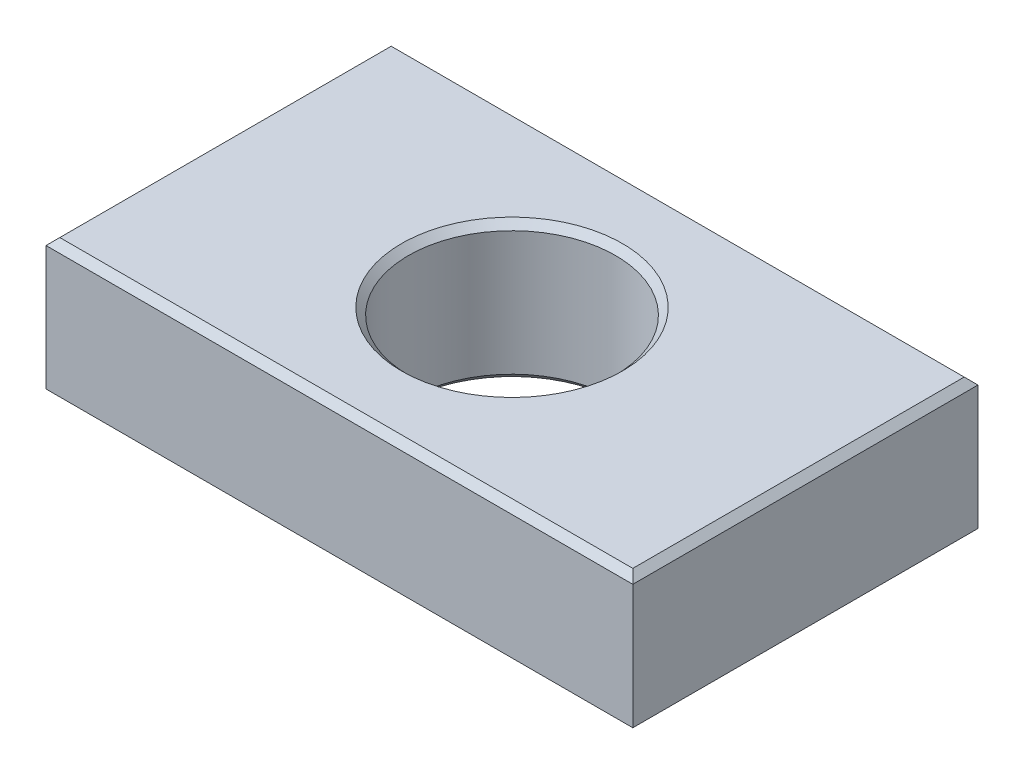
ISO-10303-21;
HEADER;
FILE_DESCRIPTION(('STEP AP214'),'2;1');
FILE_NAME('part.step','',(''),(''),'','','');
FILE_SCHEMA(('AUTOMOTIVE_DESIGN { 1 0 10303 214 1 1 1 1 }'));
ENDSEC;
DATA;
#1=APPLICATION_CONTEXT('core data for automotive mechanical design processes');
#2=APPLICATION_PROTOCOL_DEFINITION('international standard','automotive_design',2000,#1);
#3=PRODUCT_CONTEXT('',#1,'mechanical');
#4=PRODUCT('Part','Part','',(#3));
#5=PRODUCT_RELATED_PRODUCT_CATEGORY('part','',(#4));
#6=PRODUCT_DEFINITION_FORMATION('','',#4);
#7=PRODUCT_DEFINITION_CONTEXT('part definition',#1,'design');
#8=PRODUCT_DEFINITION('design','',#6,#7);
#9=PRODUCT_DEFINITION_SHAPE('','',#8);
#10=(LENGTH_UNIT() NAMED_UNIT(*) SI_UNIT(.MILLI.,.METRE.));
#11=(NAMED_UNIT(*) PLANE_ANGLE_UNIT() SI_UNIT($,.RADIAN.));
#12=(NAMED_UNIT(*) SI_UNIT($,.STERADIAN.) SOLID_ANGLE_UNIT());
#13=UNCERTAINTY_MEASURE_WITH_UNIT(LENGTH_MEASURE(1.E-05),#10,'distance_accuracy_value','');
#14=(GEOMETRIC_REPRESENTATION_CONTEXT(3) GLOBAL_UNCERTAINTY_ASSIGNED_CONTEXT((#13)) GLOBAL_UNIT_ASSIGNED_CONTEXT((#10,
#11,#12)) REPRESENTATION_CONTEXT('',''));
#15=CARTESIAN_POINT('',(0.,0.,0.));
#16=DIRECTION('',(0.,0.,1.));
#17=DIRECTION('',(1.,0.,0.));
#18=AXIS2_PLACEMENT_3D('',#15,#16,#17);
#19=CARTESIAN_POINT('',(-8.5,4.,5.));
#20=DIRECTION('',(0.,1.,0.));
#21=DIRECTION('',(0.,0.,1.));
#22=AXIS2_PLACEMENT_3D('',#19,#20,#21);
#23=PLANE('',#22);
#24=CARTESIAN_POINT('',(0.,4.,0.));
#25=DIRECTION('',(0.,1.,0.));
#26=DIRECTION('',(0.,0.,1.));
#27=AXIS2_PLACEMENT_3D('',#24,#25,#26);
#28=CIRCLE('',#27,3.2);
#29=CARTESIAN_POINT('',(0.,4.,3.2));
#30=VERTEX_POINT('',#29);
#31=EDGE_CURVE('E11',#30,#30,#28,.F.);
#32=ORIENTED_EDGE('',*,*,#31,.T.);
#33=EDGE_LOOP('',(#32));
#34=FACE_BOUND('',#33,.T.);
#35=DIRECTION('',(0.,0.,-1.));
#36=VECTOR('',#35,1.);
#37=CARTESIAN_POINT('',(8.3,4.,-5.));
#38=LINE('',#37,#36);
#39=CARTESIAN_POINT('',(8.3,4.,4.8));
#40=VERTEX_POINT('',#39);
#41=CARTESIAN_POINT('',(8.3,4.,-4.8));
#42=VERTEX_POINT('',#41);
#43=EDGE_CURVE('E46',#40,#42,#38,.T.);
#44=ORIENTED_EDGE('',*,*,#43,.T.);
#45=DIRECTION('',(-1.,0.,0.));
#46=VECTOR('',#45,1.);
#47=CARTESIAN_POINT('',(-8.5,4.,-4.8));
#48=LINE('',#47,#46);
#49=CARTESIAN_POINT('',(-8.3,4.,-4.8));
#50=VERTEX_POINT('',#49);
#51=EDGE_CURVE('E39',#42,#50,#48,.T.);
#52=ORIENTED_EDGE('',*,*,#51,.T.);
#53=DIRECTION('',(0.,0.,1.));
#54=VECTOR('',#53,1.);
#55=CARTESIAN_POINT('',(-8.29999999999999,4.,5.));
#56=LINE('',#55,#54);
#57=CARTESIAN_POINT('',(-8.29999999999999,4.,4.8));
#58=VERTEX_POINT('',#57);
#59=EDGE_CURVE('E152',#50,#58,#56,.T.);
#60=ORIENTED_EDGE('',*,*,#59,.T.);
#61=DIRECTION('',(1.,0.,0.));
#62=VECTOR('',#61,1.);
#63=CARTESIAN_POINT('',(8.5,4.,4.8));
#64=LINE('',#63,#62);
#65=EDGE_CURVE('E51',#58,#40,#64,.T.);
#66=ORIENTED_EDGE('',*,*,#65,.T.);
#67=EDGE_LOOP('',(#44,#52,#60,#66));
#68=FACE_BOUND('',#67,.T.);
#69=ADVANCED_FACE('F31',(#34,#68),#23,.T.);
#70=CARTESIAN_POINT('',(-8.5,0.,5.));
#71=DIRECTION('',(0.,1.,0.));
#72=DIRECTION('',(0.,0.,1.));
#73=AXIS2_PLACEMENT_3D('',#70,#71,#72);
#74=PLANE('',#73);
#75=CARTESIAN_POINT('',(0.,0.,0.));
#76=DIRECTION('',(0.,1.,0.));
#77=DIRECTION('',(0.,0.,1.));
#78=AXIS2_PLACEMENT_3D('',#75,#76,#77);
#79=CIRCLE('',#78,3.2);
#80=CARTESIAN_POINT('',(0.,0.,3.2));
#81=VERTEX_POINT('',#80);
#82=EDGE_CURVE('E123',#81,#81,#79,.T.);
#83=ORIENTED_EDGE('',*,*,#82,.T.);
#84=EDGE_LOOP('',(#83));
#85=FACE_BOUND('',#84,.T.);
#86=DIRECTION('',(0.,0.,1.));
#87=VECTOR('',#86,1.);
#88=CARTESIAN_POINT('',(8.3,0.,5.));
#89=LINE('',#88,#87);
#90=CARTESIAN_POINT('',(8.3,0.,-4.8));
#91=VERTEX_POINT('',#90);
#92=CARTESIAN_POINT('',(8.3,0.,4.8));
#93=VERTEX_POINT('',#92);
#94=EDGE_CURVE('E122',#91,#93,#89,.T.);
#95=ORIENTED_EDGE('',*,*,#94,.T.);
#96=DIRECTION('',(-1.,0.,0.));
#97=VECTOR('',#96,1.);
#98=CARTESIAN_POINT('',(-8.5,0.,4.8));
#99=LINE('',#98,#97);
#100=CARTESIAN_POINT('',(-8.3,0.,4.8));
#101=VERTEX_POINT('',#100);
#102=EDGE_CURVE('E101',#93,#101,#99,.T.);
#103=ORIENTED_EDGE('',*,*,#102,.T.);
#104=DIRECTION('',(0.,0.,-1.));
#105=VECTOR('',#104,1.);
#106=CARTESIAN_POINT('',(-8.3,0.,5.));
#107=LINE('',#106,#105);
#108=CARTESIAN_POINT('',(-8.3,0.,-4.8));
#109=VERTEX_POINT('',#108);
#110=EDGE_CURVE('E111',#101,#109,#107,.T.);
#111=ORIENTED_EDGE('',*,*,#110,.T.);
#112=DIRECTION('',(1.,0.,0.));
#113=VECTOR('',#112,1.);
#114=CARTESIAN_POINT('',(-8.5,0.,-4.8));
#115=LINE('',#114,#113);
#116=EDGE_CURVE('E117',#109,#91,#115,.T.);
#117=ORIENTED_EDGE('',*,*,#116,.T.);
#118=EDGE_LOOP('',(#95,#103,#111,#117));
#119=FACE_BOUND('',#118,.T.);
#120=ADVANCED_FACE('F120',(#85,#119),#74,.F.);
#121=CARTESIAN_POINT('',(-8.5,4.,-5.));
#122=DIRECTION('',(1.,0.,0.));
#123=DIRECTION('',(0.,0.,-1.));
#124=AXIS2_PLACEMENT_3D('',#121,#122,#123);
#125=PLANE('',#124);
#126=DIRECTION('',(0.,-1.,0.));
#127=VECTOR('',#126,1.);
#128=CARTESIAN_POINT('',(-8.5,4.,-5.));
#129=LINE('',#128,#127);
#130=CARTESIAN_POINT('',(-8.5,3.8,-5.));
#131=VERTEX_POINT('',#130);
#132=CARTESIAN_POINT('',(-8.5,0.200000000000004,-5.));
#133=VERTEX_POINT('',#132);
#134=EDGE_CURVE('E183',#131,#133,#129,.T.);
#135=ORIENTED_EDGE('',*,*,#134,.T.);
#136=DIRECTION('',(0.,0.,1.));
#137=VECTOR('',#136,1.);
#138=CARTESIAN_POINT('',(-8.5,0.200000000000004,-5.));
#139=LINE('',#138,#137);
#140=CARTESIAN_POINT('',(-8.5,0.200000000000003,5.));
#141=VERTEX_POINT('',#140);
#142=EDGE_CURVE('E150',#133,#141,#139,.T.);
#143=ORIENTED_EDGE('',*,*,#142,.T.);
#144=DIRECTION('',(0.,-1.,0.));
#145=VECTOR('',#144,1.);
#146=CARTESIAN_POINT('',(-8.5,4.,5.));
#147=LINE('',#146,#145);
#148=CARTESIAN_POINT('',(-8.5,3.8,5.));
#149=VERTEX_POINT('',#148);
#150=EDGE_CURVE('E118',#149,#141,#147,.T.);
#151=ORIENTED_EDGE('',*,*,#150,.F.);
#152=DIRECTION('',(0.,0.,-1.));
#153=VECTOR('',#152,1.);
#154=CARTESIAN_POINT('',(-8.5,3.8,-5.));
#155=LINE('',#154,#153);
#156=EDGE_CURVE('E148',#149,#131,#155,.T.);
#157=ORIENTED_EDGE('',*,*,#156,.T.);
#158=EDGE_LOOP('',(#135,#143,#151,#157));
#159=FACE_BOUND('',#158,.T.);
#160=ADVANCED_FACE('F33',(#159),#125,.F.);
#161=CARTESIAN_POINT('',(-8.5,4.,5.));
#162=DIRECTION('',(0.,0.,-1.));
#163=DIRECTION('',(-1.,0.,0.));
#164=AXIS2_PLACEMENT_3D('',#161,#162,#163);
#165=PLANE('',#164);
#166=ORIENTED_EDGE('',*,*,#150,.T.);
#167=DIRECTION('',(1.,0.,0.));
#168=VECTOR('',#167,1.);
#169=CARTESIAN_POINT('',(-8.5,0.200000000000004,5.));
#170=LINE('',#169,#168);
#171=CARTESIAN_POINT('',(8.5,0.200000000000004,5.));
#172=VERTEX_POINT('',#171);
#173=EDGE_CURVE('E104',#141,#172,#170,.T.);
#174=ORIENTED_EDGE('',*,*,#173,.T.);
#175=DIRECTION('',(0.,-1.,0.));
#176=VECTOR('',#175,1.);
#177=CARTESIAN_POINT('',(8.5,4.,5.));
#178=LINE('',#177,#176);
#179=CARTESIAN_POINT('',(8.5,3.8,5.));
#180=VERTEX_POINT('',#179);
#181=EDGE_CURVE('E189',#180,#172,#178,.T.);
#182=ORIENTED_EDGE('',*,*,#181,.F.);
#183=DIRECTION('',(-1.,0.,0.));
#184=VECTOR('',#183,1.);
#185=CARTESIAN_POINT('',(-8.5,3.8,5.));
#186=LINE('',#185,#184);
#187=EDGE_CURVE('E136',#180,#149,#186,.T.);
#188=ORIENTED_EDGE('',*,*,#187,.T.);
#189=EDGE_LOOP('',(#166,#174,#182,#188));
#190=FACE_BOUND('',#189,.T.);
#191=ADVANCED_FACE('F204',(#190),#165,.F.);
#192=CARTESIAN_POINT('',(8.5,4.,-5.));
#193=DIRECTION('',(-1.,0.,0.));
#194=DIRECTION('',(0.,0.,1.));
#195=AXIS2_PLACEMENT_3D('',#192,#193,#194);
#196=PLANE('',#195);
#197=ORIENTED_EDGE('',*,*,#181,.T.);
#198=DIRECTION('',(0.,0.,-1.));
#199=VECTOR('',#198,1.);
#200=CARTESIAN_POINT('',(8.5,0.200000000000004,-5.));
#201=LINE('',#200,#199);
#202=CARTESIAN_POINT('',(8.5,0.200000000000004,-5.));
#203=VERTEX_POINT('',#202);
#204=EDGE_CURVE('E141',#172,#203,#201,.T.);
#205=ORIENTED_EDGE('',*,*,#204,.T.);
#206=DIRECTION('',(0.,-1.,0.));
#207=VECTOR('',#206,1.);
#208=CARTESIAN_POINT('',(8.5,4.,-5.));
#209=LINE('',#208,#207);
#210=CARTESIAN_POINT('',(8.5,3.8,-5.));
#211=VERTEX_POINT('',#210);
#212=EDGE_CURVE('E186',#211,#203,#209,.T.);
#213=ORIENTED_EDGE('',*,*,#212,.F.);
#214=DIRECTION('',(0.,0.,1.));
#215=VECTOR('',#214,1.);
#216=CARTESIAN_POINT('',(8.5,3.8,5.));
#217=LINE('',#216,#215);
#218=EDGE_CURVE('E139',#211,#180,#217,.T.);
#219=ORIENTED_EDGE('',*,*,#218,.T.);
#220=EDGE_LOOP('',(#197,#205,#213,#219));
#221=FACE_BOUND('',#220,.T.);
#222=ADVANCED_FACE('F206',(#221),#196,.F.);
#223=CARTESIAN_POINT('',(-8.5,4.,-5.));
#224=DIRECTION('',(0.,0.,1.));
#225=DIRECTION('',(1.,0.,0.));
#226=AXIS2_PLACEMENT_3D('',#223,#224,#225);
#227=PLANE('',#226);
#228=ORIENTED_EDGE('',*,*,#212,.T.);
#229=DIRECTION('',(-1.,0.,0.));
#230=VECTOR('',#229,1.);
#231=CARTESIAN_POINT('',(-8.5,0.200000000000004,-5.));
#232=LINE('',#231,#230);
#233=EDGE_CURVE('E146',#203,#133,#232,.T.);
#234=ORIENTED_EDGE('',*,*,#233,.T.);
#235=ORIENTED_EDGE('',*,*,#134,.F.);
#236=DIRECTION('',(1.,0.,0.));
#237=VECTOR('',#236,1.);
#238=CARTESIAN_POINT('',(8.5,3.8,-5.));
#239=LINE('',#238,#237);
#240=EDGE_CURVE('E143',#131,#211,#239,.T.);
#241=ORIENTED_EDGE('',*,*,#240,.T.);
#242=EDGE_LOOP('',(#228,#234,#235,#241));
#243=FACE_BOUND('',#242,.T.);
#244=ADVANCED_FACE('F211',(#243),#227,.F.);
#245=CARTESIAN_POINT('',(0.,4.,0.));
#246=DIRECTION('',(0.,-1.,0.));
#247=DIRECTION('',(0.,0.,-1.));
#248=AXIS2_PLACEMENT_3D('',#245,#246,#247);
#249=CYLINDRICAL_SURFACE('',#248,3.);
#250=CARTESIAN_POINT('',(0.,0.200000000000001,0.));
#251=DIRECTION('',(0.,1.,0.));
#252=DIRECTION('',(0.,0.,1.));
#253=AXIS2_PLACEMENT_3D('',#250,#251,#252);
#254=CIRCLE('',#253,3.);
#255=CARTESIAN_POINT('',(0.,0.200000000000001,3.));
#256=VERTEX_POINT('',#255);
#257=EDGE_CURVE('E133',#256,#256,#254,.F.);
#258=ORIENTED_EDGE('',*,*,#257,.T.);
#259=EDGE_LOOP('',(#258));
#260=FACE_BOUND('',#259,.T.);
#261=CARTESIAN_POINT('',(0.,3.8,0.));
#262=DIRECTION('',(0.,1.,0.));
#263=DIRECTION('',(0.,0.,1.));
#264=AXIS2_PLACEMENT_3D('',#261,#262,#263);
#265=CIRCLE('',#264,3.);
#266=CARTESIAN_POINT('',(0.,3.8,3.));
#267=VERTEX_POINT('',#266);
#268=EDGE_CURVE('E126',#267,#267,#265,.T.);
#269=ORIENTED_EDGE('',*,*,#268,.T.);
#270=EDGE_LOOP('',(#269));
#271=FACE_BOUND('',#270,.T.);
#272=ADVANCED_FACE('F229',(#260,#271),#249,.F.);
#273=CARTESIAN_POINT('',(0.,0.,0.));
#274=DIRECTION('',(0.,-1.,0.));
#275=DIRECTION('',(0.,0.,-1.));
#276=AXIS2_PLACEMENT_3D('',#273,#274,#275);
#277=CONICAL_SURFACE('',#276,3.2,0.785398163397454);
#278=ORIENTED_EDGE('',*,*,#257,.F.);
#279=EDGE_LOOP('',(#278));
#280=FACE_BOUND('',#279,.T.);
#281=ORIENTED_EDGE('',*,*,#82,.F.);
#282=EDGE_LOOP('',(#281));
#283=FACE_BOUND('',#282,.T.);
#284=ADVANCED_FACE('F245',(#280,#283),#277,.F.);
#285=CARTESIAN_POINT('',(-8.5,0.200000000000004,-5.));
#286=DIRECTION('',(0.,0.707106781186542,0.707106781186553));
#287=DIRECTION('',(0.,-0.707106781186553,0.707106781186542));
#288=AXIS2_PLACEMENT_3D('',#285,#286,#287);
#289=PLANE('',#288);
#290=DIRECTION('',(-0.57735026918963,-0.577350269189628,0.57735026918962));
#291=VECTOR('',#290,1.);
#292=CARTESIAN_POINT('',(2.83333333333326,-5.46666666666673,0.666666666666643));
#293=LINE('',#292,#291);
#294=EDGE_CURVE('E107',#91,#203,#293,.F.);
#295=ORIENTED_EDGE('',*,*,#294,.F.);
#296=ORIENTED_EDGE('',*,*,#116,.F.);
#297=DIRECTION('',(0.577350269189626,-0.57735026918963,0.577350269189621));
#298=VECTOR('',#297,1.);
#299=CARTESIAN_POINT('',(-8.5,0.200000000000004,-5.));
#300=LINE('',#299,#298);
#301=EDGE_CURVE('E114',#133,#109,#300,.T.);
#302=ORIENTED_EDGE('',*,*,#301,.F.);
#303=ORIENTED_EDGE('',*,*,#233,.F.);
#304=EDGE_LOOP('',(#295,#296,#302,#303));
#305=FACE_BOUND('',#304,.T.);
#306=ADVANCED_FACE('F196',(#305),#289,.F.);
#307=CARTESIAN_POINT('',(-8.5,0.200000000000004,-5.));
#308=DIRECTION('',(0.70710678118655,0.707106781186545,0.));
#309=DIRECTION('',(-0.707106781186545,0.70710678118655,0.));
#310=AXIS2_PLACEMENT_3D('',#307,#308,#309);
#311=PLANE('',#310);
#312=ORIENTED_EDGE('',*,*,#301,.T.);
#313=ORIENTED_EDGE('',*,*,#110,.F.);
#314=DIRECTION('',(-0.577350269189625,0.577350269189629,0.577350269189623));
#315=VECTOR('',#314,1.);
#316=CARTESIAN_POINT('',(-5.16666666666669,-3.13333333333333,1.6666666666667));
#317=LINE('',#316,#315);
#318=EDGE_CURVE('E97',#141,#101,#317,.F.);
#319=ORIENTED_EDGE('',*,*,#318,.F.);
#320=ORIENTED_EDGE('',*,*,#142,.F.);
#321=EDGE_LOOP('',(#312,#313,#319,#320));
#322=FACE_BOUND('',#321,.T.);
#323=ADVANCED_FACE('F112',(#322),#311,.F.);
#324=CARTESIAN_POINT('',(8.5,0.200000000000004,-5.));
#325=DIRECTION('',(-0.707106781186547,0.707106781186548,0.));
#326=DIRECTION('',(-0.707106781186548,-0.707106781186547,0.));
#327=AXIS2_PLACEMENT_3D('',#324,#325,#326);
#328=PLANE('',#327);
#329=ORIENTED_EDGE('',*,*,#294,.T.);
#330=ORIENTED_EDGE('',*,*,#204,.F.);
#331=DIRECTION('',(-0.577350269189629,-0.577350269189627,-0.577350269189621));
#332=VECTOR('',#331,1.);
#333=CARTESIAN_POINT('',(5.16666666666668,-3.13333333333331,1.66666666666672));
#334=LINE('',#333,#332);
#335=EDGE_CURVE('E108',#93,#172,#334,.F.);
#336=ORIENTED_EDGE('',*,*,#335,.F.);
#337=ORIENTED_EDGE('',*,*,#94,.F.);
#338=EDGE_LOOP('',(#329,#330,#336,#337));
#339=FACE_BOUND('',#338,.T.);
#340=ADVANCED_FACE('F199',(#339),#328,.F.);
#341=CARTESIAN_POINT('',(-8.5,0.200000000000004,5.));
#342=DIRECTION('',(0.,0.707106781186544,-0.707106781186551));
#343=DIRECTION('',(0.,0.707106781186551,0.707106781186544));
#344=AXIS2_PLACEMENT_3D('',#341,#342,#343);
#345=PLANE('',#344);
#346=ORIENTED_EDGE('',*,*,#318,.T.);
#347=ORIENTED_EDGE('',*,*,#102,.F.);
#348=ORIENTED_EDGE('',*,*,#335,.T.);
#349=ORIENTED_EDGE('',*,*,#173,.F.);
#350=EDGE_LOOP('',(#346,#347,#348,#349));
#351=FACE_BOUND('',#350,.T.);
#352=ADVANCED_FACE('F99',(#351),#345,.F.);
#353=CARTESIAN_POINT('',(0.,3.8,0.));
#354=DIRECTION('',(0.,1.,0.));
#355=DIRECTION('',(0.,0.,1.));
#356=AXIS2_PLACEMENT_3D('',#353,#354,#355);
#357=CONICAL_SURFACE('',#356,3.,0.785398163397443);
#358=ORIENTED_EDGE('',*,*,#31,.F.);
#359=EDGE_LOOP('',(#358));
#360=FACE_BOUND('',#359,.T.);
#361=ORIENTED_EDGE('',*,*,#268,.F.);
#362=EDGE_LOOP('',(#361));
#363=FACE_BOUND('',#362,.T.);
#364=ADVANCED_FACE('F277',(#360,#363),#357,.F.);
#365=CARTESIAN_POINT('',(-8.5,4.,4.8));
#366=DIRECTION('',(0.,0.707106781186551,0.707106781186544));
#367=DIRECTION('',(0.,-0.707106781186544,0.707106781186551));
#368=AXIS2_PLACEMENT_3D('',#365,#366,#367);
#369=PLANE('',#368);
#370=DIRECTION('',(0.577350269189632,0.57735026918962,-0.577350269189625));
#371=VECTOR('',#370,1.);
#372=CARTESIAN_POINT('',(-8.36666666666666,3.93333333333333,4.86666666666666));
#373=LINE('',#372,#371);
#374=EDGE_CURVE('E170',#149,#58,#373,.T.);
#375=ORIENTED_EDGE('',*,*,#374,.F.);
#376=ORIENTED_EDGE('',*,*,#187,.F.);
#377=DIRECTION('',(-0.577350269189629,0.577350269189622,-0.577350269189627));
#378=VECTOR('',#377,1.);
#379=CARTESIAN_POINT('',(2.69999999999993,9.59999999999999,-0.800000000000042));
#380=LINE('',#379,#378);
#381=EDGE_CURVE('E173',#40,#180,#380,.F.);
#382=ORIENTED_EDGE('',*,*,#381,.F.);
#383=ORIENTED_EDGE('',*,*,#65,.F.);
#384=EDGE_LOOP('',(#375,#376,#382,#383));
#385=FACE_BOUND('',#384,.T.);
#386=ADVANCED_FACE('F284',(#385),#369,.T.);
#387=CARTESIAN_POINT('',(8.3,4.,5.));
#388=DIRECTION('',(0.707106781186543,0.707106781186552,0.));
#389=DIRECTION('',(-0.707106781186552,0.707106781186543,0.));
#390=AXIS2_PLACEMENT_3D('',#387,#388,#389);
#391=PLANE('',#390);
#392=ORIENTED_EDGE('',*,*,#381,.T.);
#393=ORIENTED_EDGE('',*,*,#218,.F.);
#394=DIRECTION('',(-0.577350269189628,0.577350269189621,0.577350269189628));
#395=VECTOR('',#394,1.);
#396=CARTESIAN_POINT('',(5.0333333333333,7.26666666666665,-1.5333333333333));
#397=LINE('',#396,#395);
#398=EDGE_CURVE('E160',#42,#211,#397,.F.);
#399=ORIENTED_EDGE('',*,*,#398,.F.);
#400=ORIENTED_EDGE('',*,*,#43,.F.);
#401=EDGE_LOOP('',(#392,#393,#399,#400));
#402=FACE_BOUND('',#401,.T.);
#403=ADVANCED_FACE('F208',(#402),#391,.T.);
#404=CARTESIAN_POINT('',(-8.29999999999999,4.,5.));
#405=DIRECTION('',(-0.70710678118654,0.707106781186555,0.));
#406=DIRECTION('',(-0.707106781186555,-0.70710678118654,0.));
#407=AXIS2_PLACEMENT_3D('',#404,#405,#406);
#408=PLANE('',#407);
#409=ORIENTED_EDGE('',*,*,#374,.T.);
#410=ORIENTED_EDGE('',*,*,#59,.F.);
#411=DIRECTION('',(-0.577350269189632,-0.577350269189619,-0.577350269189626));
#412=VECTOR('',#411,1.);
#413=CARTESIAN_POINT('',(-5.03333333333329,7.26666666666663,-1.53333333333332));
#414=LINE('',#413,#412);
#415=EDGE_CURVE('E163',#131,#50,#414,.F.);
#416=ORIENTED_EDGE('',*,*,#415,.F.);
#417=ORIENTED_EDGE('',*,*,#156,.F.);
#418=EDGE_LOOP('',(#409,#410,#416,#417));
#419=FACE_BOUND('',#418,.T.);
#420=ADVANCED_FACE('F168',(#419),#408,.T.);
#421=CARTESIAN_POINT('',(-8.5,4.,-4.8));
#422=DIRECTION('',(0.,0.707106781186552,-0.707106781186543));
#423=DIRECTION('',(0.,0.707106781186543,0.707106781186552));
#424=AXIS2_PLACEMENT_3D('',#421,#422,#423);
#425=PLANE('',#424);
#426=ORIENTED_EDGE('',*,*,#398,.T.);
#427=ORIENTED_EDGE('',*,*,#240,.F.);
#428=ORIENTED_EDGE('',*,*,#415,.T.);
#429=ORIENTED_EDGE('',*,*,#51,.F.);
#430=EDGE_LOOP('',(#426,#427,#428,#429));
#431=FACE_BOUND('',#430,.T.);
#432=ADVANCED_FACE('F158',(#431),#425,.T.);
#433=CLOSED_SHELL('',(#69,#120,#160,#191,#222,#244,#272,#284,#306,#323,#340,#352,#364,#386,#403,
#420,#432));
#434=MANIFOLD_SOLID_BREP('B2',#433);
#435=ADVANCED_BREP_SHAPE_REPRESENTATION('',(#18,#434),#14);
#436=SHAPE_DEFINITION_REPRESENTATION(#9,#435);
ENDSEC;
END-ISO-10303-21;
